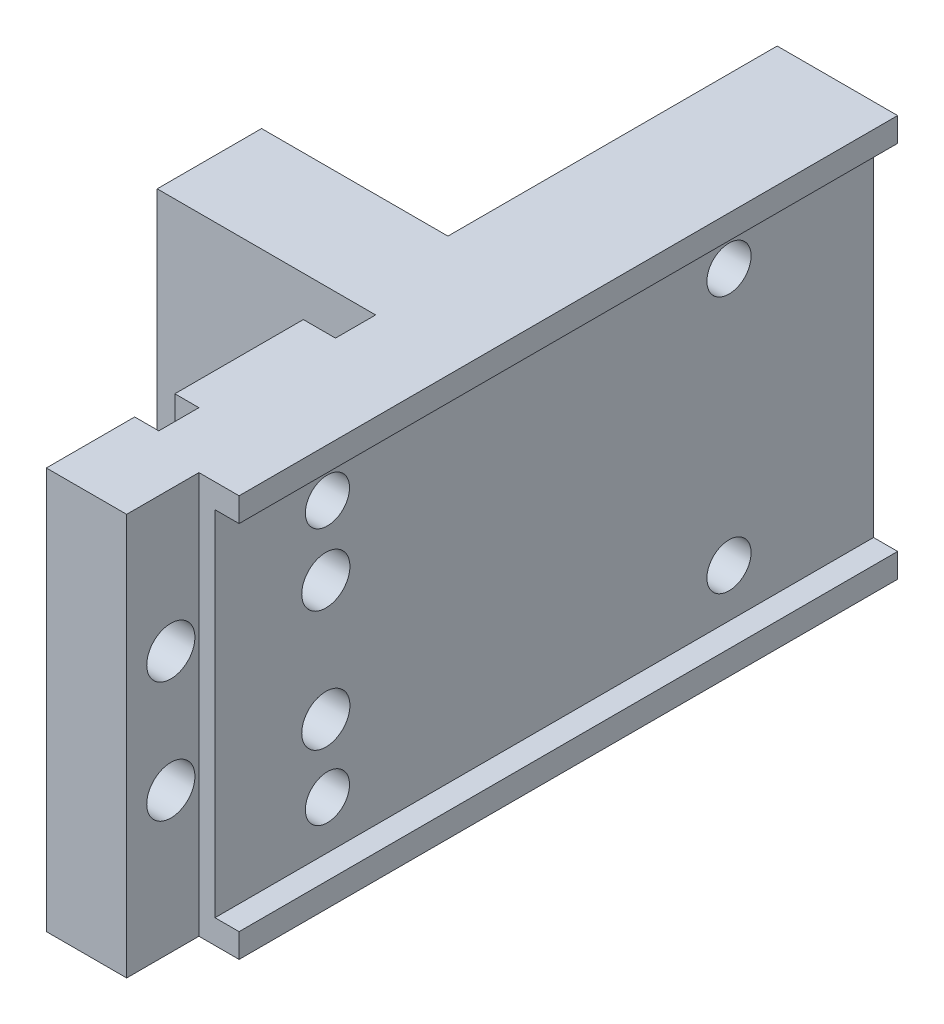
ISO-10303-21;
HEADER;
FILE_DESCRIPTION(('STEP AP214'),'2;1');
FILE_NAME('part.step','',(''),(''),'','','');
FILE_SCHEMA(('AUTOMOTIVE_DESIGN { 1 0 10303 214 1 1 1 1 }'));
ENDSEC;
DATA;
#1=APPLICATION_CONTEXT('core data for automotive mechanical design processes');
#2=APPLICATION_PROTOCOL_DEFINITION('international standard','automotive_design',2000,#1);
#3=PRODUCT_CONTEXT('',#1,'mechanical');
#4=PRODUCT('Part','Part','',(#3));
#5=PRODUCT_RELATED_PRODUCT_CATEGORY('part','',(#4));
#6=PRODUCT_DEFINITION_FORMATION('','',#4);
#7=PRODUCT_DEFINITION_CONTEXT('part definition',#1,'design');
#8=PRODUCT_DEFINITION('design','',#6,#7);
#9=PRODUCT_DEFINITION_SHAPE('','',#8);
#10=(LENGTH_UNIT() NAMED_UNIT(*) SI_UNIT(.MILLI.,.METRE.));
#11=(NAMED_UNIT(*) PLANE_ANGLE_UNIT() SI_UNIT($,.RADIAN.));
#12=(NAMED_UNIT(*) SI_UNIT($,.STERADIAN.) SOLID_ANGLE_UNIT());
#13=UNCERTAINTY_MEASURE_WITH_UNIT(LENGTH_MEASURE(1.E-05),#10,'distance_accuracy_value','');
#14=(GEOMETRIC_REPRESENTATION_CONTEXT(3) GLOBAL_UNCERTAINTY_ASSIGNED_CONTEXT((#13)) GLOBAL_UNIT_ASSIGNED_CONTEXT((#10,
#11,#12)) REPRESENTATION_CONTEXT('',''));
#15=CARTESIAN_POINT('',(0.,0.,0.));
#16=DIRECTION('',(0.,0.,1.));
#17=DIRECTION('',(1.,0.,0.));
#18=AXIS2_PLACEMENT_3D('',#15,#16,#17);
#19=CARTESIAN_POINT('',(-15.,-25.,-41.));
#20=DIRECTION('',(0.,-1.,0.));
#21=DIRECTION('',(0.,0.,-1.));
#22=AXIS2_PLACEMENT_3D('',#19,#20,#21);
#23=PLANE('',#22);
#24=DIRECTION('',(0.,0.,-1.));
#25=VECTOR('',#24,1.);
#26=CARTESIAN_POINT('',(-24.2,-25.,50.001));
#27=LINE('',#26,#25);
#28=CARTESIAN_POINT('',(-24.2,-25.,13.));
#29=VERTEX_POINT('',#28);
#30=CARTESIAN_POINT('',(-24.2,-25.,0.));
#31=VERTEX_POINT('',#30);
#32=EDGE_CURVE('E279',#29,#31,#27,.T.);
#33=ORIENTED_EDGE('',*,*,#32,.T.);
#34=DIRECTION('',(-1.,0.,0.));
#35=VECTOR('',#34,1.);
#36=CARTESIAN_POINT('',(-38.2,-25.0000000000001,0.));
#37=LINE('',#36,#35);
#38=CARTESIAN_POINT('',(-15.,-25.,0.));
#39=VERTEX_POINT('',#38);
#40=EDGE_CURVE('E395',#39,#31,#37,.T.);
#41=ORIENTED_EDGE('',*,*,#40,.F.);
#42=DIRECTION('',(0.,0.,1.));
#43=VECTOR('',#42,1.);
#44=CARTESIAN_POINT('',(-15.,-25.,0.));
#45=LINE('',#44,#43);
#46=CARTESIAN_POINT('',(-15.,-25.,-41.));
#47=VERTEX_POINT('',#46);
#48=EDGE_CURVE('E356',#47,#39,#45,.T.);
#49=ORIENTED_EDGE('',*,*,#48,.F.);
#50=DIRECTION('',(-1.,0.,0.));
#51=VECTOR('',#50,1.);
#52=CARTESIAN_POINT('',(-15.,-25.,-41.));
#53=LINE('',#52,#51);
#54=CARTESIAN_POINT('',(0.,-25.,-41.));
#55=VERTEX_POINT('',#54);
#56=EDGE_CURVE('E361',#55,#47,#53,.T.);
#57=ORIENTED_EDGE('',*,*,#56,.F.);
#58=DIRECTION('',(0.,0.,-1.));
#59=VECTOR('',#58,1.);
#60=CARTESIAN_POINT('',(0.,-25.,-41.));
#61=LINE('',#60,#59);
#62=CARTESIAN_POINT('',(0.,-25.,41.));
#63=VERTEX_POINT('',#62);
#64=EDGE_CURVE('E425',#63,#55,#61,.T.);
#65=ORIENTED_EDGE('',*,*,#64,.F.);
#66=DIRECTION('',(1.,0.,0.));
#67=VECTOR('',#66,1.);
#68=CARTESIAN_POINT('',(0.,-25.,41.));
#69=LINE('',#68,#67);
#70=CARTESIAN_POINT('',(-4.99999999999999,-25.,41.));
#71=VERTEX_POINT('',#70);
#72=EDGE_CURVE('E422',#71,#63,#69,.T.);
#73=ORIENTED_EDGE('',*,*,#72,.F.);
#74=DIRECTION('',(0.,0.,-1.));
#75=VECTOR('',#74,1.);
#76=CARTESIAN_POINT('',(-4.99999999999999,-25.,41.));
#77=LINE('',#76,#75);
#78=CARTESIAN_POINT('',(-4.99999999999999,-25.,50.));
#79=VERTEX_POINT('',#78);
#80=EDGE_CURVE('E420',#79,#71,#77,.T.);
#81=ORIENTED_EDGE('',*,*,#80,.F.);
#82=DIRECTION('',(1.,0.,0.));
#83=VECTOR('',#82,1.);
#84=CARTESIAN_POINT('',(-4.99999999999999,-25.,50.));
#85=LINE('',#84,#83);
#86=CARTESIAN_POINT('',(-15.,-25.,50.));
#87=VERTEX_POINT('',#86);
#88=EDGE_CURVE('E418',#87,#79,#85,.T.);
#89=ORIENTED_EDGE('',*,*,#88,.F.);
#90=DIRECTION('',(0.,0.,1.));
#91=VECTOR('',#90,1.);
#92=CARTESIAN_POINT('',(-15.,-25.,50.));
#93=LINE('',#92,#91);
#94=CARTESIAN_POINT('',(-15.,-25.,39.));
#95=VERTEX_POINT('',#94);
#96=EDGE_CURVE('E416',#95,#87,#93,.T.);
#97=ORIENTED_EDGE('',*,*,#96,.F.);
#98=DIRECTION('',(-1.,0.,0.));
#99=VECTOR('',#98,1.);
#100=CARTESIAN_POINT('',(-15.,-25.,39.));
#101=LINE('',#100,#99);
#102=CARTESIAN_POINT('',(-12.,-25.,39.));
#103=VERTEX_POINT('',#102);
#104=EDGE_CURVE('E414',#103,#95,#101,.T.);
#105=ORIENTED_EDGE('',*,*,#104,.F.);
#106=DIRECTION('',(0.,0.,1.));
#107=VECTOR('',#106,1.);
#108=CARTESIAN_POINT('',(-12.,-25.,39.));
#109=LINE('',#108,#107);
#110=CARTESIAN_POINT('',(-12.,-25.,34.));
#111=VERTEX_POINT('',#110);
#112=EDGE_CURVE('E412',#111,#103,#109,.T.);
#113=ORIENTED_EDGE('',*,*,#112,.F.);
#114=DIRECTION('',(1.,0.,0.));
#115=VECTOR('',#114,1.);
#116=CARTESIAN_POINT('',(-12.,-25.,34.));
#117=LINE('',#116,#115);
#118=CARTESIAN_POINT('',(-15.,-25.,34.));
#119=VERTEX_POINT('',#118);
#120=EDGE_CURVE('E410',#119,#111,#117,.T.);
#121=ORIENTED_EDGE('',*,*,#120,.F.);
#122=DIRECTION('',(0.,0.,1.));
#123=VECTOR('',#122,1.);
#124=CARTESIAN_POINT('',(-15.,-25.,34.));
#125=LINE('',#124,#123);
#126=CARTESIAN_POINT('',(-15.,-25.,18.));
#127=VERTEX_POINT('',#126);
#128=EDGE_CURVE('E408',#127,#119,#125,.T.);
#129=ORIENTED_EDGE('',*,*,#128,.F.);
#130=DIRECTION('',(-1.,0.,0.));
#131=VECTOR('',#130,1.);
#132=CARTESIAN_POINT('',(-15.,-25.,18.));
#133=LINE('',#132,#131);
#134=CARTESIAN_POINT('',(-11.,-25.,18.));
#135=VERTEX_POINT('',#134);
#136=EDGE_CURVE('E406',#135,#127,#133,.T.);
#137=ORIENTED_EDGE('',*,*,#136,.F.);
#138=DIRECTION('',(0.,0.,1.));
#139=VECTOR('',#138,1.);
#140=CARTESIAN_POINT('',(-11.,-25.,18.));
#141=LINE('',#140,#139);
#142=CARTESIAN_POINT('',(-11.,-25.,13.));
#143=VERTEX_POINT('',#142);
#144=EDGE_CURVE('E404',#143,#135,#141,.T.);
#145=ORIENTED_EDGE('',*,*,#144,.F.);
#146=DIRECTION('',(1.,0.,0.));
#147=VECTOR('',#146,1.);
#148=CARTESIAN_POINT('',(-11.,-25.,13.));
#149=LINE('',#148,#147);
#150=EDGE_CURVE('E400',#29,#143,#149,.T.);
#151=ORIENTED_EDGE('',*,*,#150,.F.);
#152=EDGE_LOOP('',(#33,#41,#49,#57,#65,#73,#81,#89,#97,#105,#113,#121,#129,#137,#145,#151));
#153=FACE_BOUND('',#152,.T.);
#154=ADVANCED_FACE('F31',(#153),#23,.T.);
#155=CARTESIAN_POINT('',(-15.,25.,0.));
#156=DIRECTION('',(1.,0.,0.));
#157=DIRECTION('',(0.,0.,-1.));
#158=AXIS2_PLACEMENT_3D('',#155,#156,#157);
#159=PLANE('',#158);
#160=DIRECTION('',(0.,-1.,0.));
#161=VECTOR('',#160,1.);
#162=CARTESIAN_POINT('',(-15.,25.,-41.));
#163=LINE('',#162,#161);
#164=CARTESIAN_POINT('',(-15.,25.,-41.));
#165=VERTEX_POINT('',#164);
#166=CARTESIAN_POINT('',(-15.,22.,-41.));
#167=VERTEX_POINT('',#166);
#168=EDGE_CURVE('E430',#165,#167,#163,.T.);
#169=ORIENTED_EDGE('',*,*,#168,.T.);
#170=DIRECTION('',(0.,0.,-1.));
#171=VECTOR('',#170,1.);
#172=CARTESIAN_POINT('',(-15.,22.,-41.));
#173=LINE('',#172,#171);
#174=CARTESIAN_POINT('',(-15.,22.,-6.));
#175=VERTEX_POINT('',#174);
#176=EDGE_CURVE('E295',#175,#167,#173,.T.);
#177=ORIENTED_EDGE('',*,*,#176,.F.);
#178=CARTESIAN_POINT('',(-15.,16.,-6.));
#179=DIRECTION('',(-1.,0.,0.));
#180=DIRECTION('',(0.,0.,-1.));
#181=AXIS2_PLACEMENT_3D('',#178,#179,#180);
#182=CIRCLE('',#181,6.);
#183=CARTESIAN_POINT('',(-15.,16.,0.));
#184=VERTEX_POINT('',#183);
#185=EDGE_CURVE('E315',#184,#175,#182,.T.);
#186=ORIENTED_EDGE('',*,*,#185,.F.);
#187=DIRECTION('',(0.,-1.,0.));
#188=VECTOR('',#187,1.);
#189=CARTESIAN_POINT('',(-15.,25.,0.));
#190=LINE('',#189,#188);
#191=CARTESIAN_POINT('',(-15.,25.,0.));
#192=VERTEX_POINT('',#191);
#193=EDGE_CURVE('E11',#192,#184,#190,.T.);
#194=ORIENTED_EDGE('',*,*,#193,.F.);
#195=DIRECTION('',(0.,0.,1.));
#196=VECTOR('',#195,1.);
#197=CARTESIAN_POINT('',(-15.,25.,0.));
#198=LINE('',#197,#196);
#199=EDGE_CURVE('E357',#165,#192,#198,.T.);
#200=ORIENTED_EDGE('',*,*,#199,.F.);
#201=EDGE_LOOP('',(#169,#177,#186,#194,#200));
#202=FACE_BOUND('',#201,.T.);
#203=ADVANCED_FACE('F537',(#202),#159,.F.);
#204=CARTESIAN_POINT('',(0.,25.,-41.));
#205=DIRECTION('',(-1.,0.,0.));
#206=DIRECTION('',(0.,0.,1.));
#207=AXIS2_PLACEMENT_3D('',#204,#205,#206);
#208=PLANE('',#207);
#209=DIRECTION('',(0.,-1.,0.));
#210=VECTOR('',#209,1.);
#211=CARTESIAN_POINT('',(0.,25.,41.));
#212=LINE('',#211,#210);
#213=CARTESIAN_POINT('',(0.,25.,41.));
#214=VERTEX_POINT('',#213);
#215=CARTESIAN_POINT('',(0.,22.,41.));
#216=VERTEX_POINT('',#215);
#217=EDGE_CURVE('E438',#214,#216,#212,.T.);
#218=ORIENTED_EDGE('',*,*,#217,.T.);
#219=DIRECTION('',(0.,0.,-1.));
#220=VECTOR('',#219,1.);
#221=CARTESIAN_POINT('',(0.,22.,50.001));
#222=LINE('',#221,#220);
#223=CARTESIAN_POINT('',(0.,22.,-41.));
#224=VERTEX_POINT('',#223);
#225=EDGE_CURVE('E346',#216,#224,#222,.T.);
#226=ORIENTED_EDGE('',*,*,#225,.T.);
#227=DIRECTION('',(0.,-1.,0.));
#228=VECTOR('',#227,1.);
#229=CARTESIAN_POINT('',(0.,25.,-41.));
#230=LINE('',#229,#228);
#231=CARTESIAN_POINT('',(0.,25.,-41.));
#232=VERTEX_POINT('',#231);
#233=EDGE_CURVE('E434',#232,#224,#230,.T.);
#234=ORIENTED_EDGE('',*,*,#233,.F.);
#235=DIRECTION('',(0.,0.,-1.));
#236=VECTOR('',#235,1.);
#237=CARTESIAN_POINT('',(0.,25.,-41.));
#238=LINE('',#237,#236);
#239=EDGE_CURVE('E387',#214,#232,#238,.T.);
#240=ORIENTED_EDGE('',*,*,#239,.F.);
#241=EDGE_LOOP('',(#218,#226,#234,#240));
#242=FACE_BOUND('',#241,.T.);
#243=ADVANCED_FACE('F546',(#242),#208,.F.);
#244=CARTESIAN_POINT('',(-15.,-16.,0.));
#245=VERTEX_POINT('',#244);
#246=EDGE_CURVE('E40',#245,#39,#190,.T.);
#247=ORIENTED_EDGE('',*,*,#246,.F.);
#248=CARTESIAN_POINT('',(-15.,-16.,-5.99999999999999));
#249=DIRECTION('',(-1.,0.,0.));
#250=DIRECTION('',(0.,0.,1.));
#251=AXIS2_PLACEMENT_3D('',#248,#249,#250);
#252=CIRCLE('',#251,6.);
#253=CARTESIAN_POINT('',(-15.,-22.,-5.99999999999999));
#254=VERTEX_POINT('',#253);
#255=EDGE_CURVE('E312',#254,#245,#252,.T.);
#256=ORIENTED_EDGE('',*,*,#255,.F.);
#257=DIRECTION('',(0.,0.,1.));
#258=VECTOR('',#257,1.);
#259=CARTESIAN_POINT('',(-15.,-22.,-41.));
#260=LINE('',#259,#258);
#261=CARTESIAN_POINT('',(-15.,-22.,-41.));
#262=VERTEX_POINT('',#261);
#263=EDGE_CURVE('E290',#262,#254,#260,.T.);
#264=ORIENTED_EDGE('',*,*,#263,.F.);
#265=EDGE_CURVE('E391',#262,#47,#163,.T.);
#266=ORIENTED_EDGE('',*,*,#265,.T.);
#267=ORIENTED_EDGE('',*,*,#48,.T.);
#268=EDGE_LOOP('',(#247,#256,#264,#266,#267));
#269=FACE_BOUND('',#268,.T.);
#270=ADVANCED_FACE('F33',(#269),#159,.F.);
#271=CARTESIAN_POINT('',(-38.2,25.,0.));
#272=DIRECTION('',(0.,0.,1.));
#273=DIRECTION('',(1.,0.,0.));
#274=AXIS2_PLACEMENT_3D('',#271,#272,#273);
#275=PLANE('',#274);
#276=ORIENTED_EDGE('',*,*,#40,.T.);
#277=DIRECTION('',(0.,-1.,0.));
#278=VECTOR('',#277,1.);
#279=CARTESIAN_POINT('',(-24.2,0.,0.));
#280=LINE('',#279,#278);
#281=CARTESIAN_POINT('',(-24.2,-8.23483454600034,0.));
#282=VERTEX_POINT('',#281);
#283=EDGE_CURVE('E276',#282,#31,#280,.T.);
#284=ORIENTED_EDGE('',*,*,#283,.F.);
#285=CARTESIAN_POINT('',(-24.7,0.,0.));
#286=DIRECTION('',(0.,0.,-1.));
#287=DIRECTION('',(-1.,0.,0.));
#288=AXIS2_PLACEMENT_3D('',#285,#286,#287);
#289=CIRCLE('',#288,8.24999999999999);
#290=CARTESIAN_POINT('',(-25.2,-8.23483454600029,0.));
#291=VERTEX_POINT('',#290);
#292=EDGE_CURVE('E282',#291,#282,#289,.T.);
#293=ORIENTED_EDGE('',*,*,#292,.F.);
#294=DIRECTION('',(0.,1.,0.));
#295=VECTOR('',#294,1.);
#296=CARTESIAN_POINT('',(-25.2,0.,0.));
#297=LINE('',#296,#295);
#298=CARTESIAN_POINT('',(-25.2,-25.,0.));
#299=VERTEX_POINT('',#298);
#300=EDGE_CURVE('E48',#299,#291,#297,.T.);
#301=ORIENTED_EDGE('',*,*,#300,.F.);
#302=CARTESIAN_POINT('',(-38.2,-25.0000000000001,0.));
#303=VERTEX_POINT('',#302);
#304=EDGE_CURVE('E394',#299,#303,#37,.T.);
#305=ORIENTED_EDGE('',*,*,#304,.T.);
#306=DIRECTION('',(0.,-1.,0.));
#307=VECTOR('',#306,1.);
#308=CARTESIAN_POINT('',(-38.2,25.,0.));
#309=LINE('',#308,#307);
#310=CARTESIAN_POINT('',(-38.2,25.,0.));
#311=VERTEX_POINT('',#310);
#312=EDGE_CURVE('E474',#311,#303,#309,.T.);
#313=ORIENTED_EDGE('',*,*,#312,.F.);
#314=DIRECTION('',(-1.,0.,0.));
#315=VECTOR('',#314,1.);
#316=CARTESIAN_POINT('',(-38.2,25.,0.));
#317=LINE('',#316,#315);
#318=EDGE_CURVE('E360',#192,#311,#317,.T.);
#319=ORIENTED_EDGE('',*,*,#318,.F.);
#320=ORIENTED_EDGE('',*,*,#193,.T.);
#321=DIRECTION('',(-1.,0.,0.));
#322=VECTOR('',#321,1.);
#323=CARTESIAN_POINT('',(-9.99999999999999,16.,0.));
#324=LINE('',#323,#322);
#325=CARTESIAN_POINT('',(-9.99999999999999,16.,0.));
#326=VERTEX_POINT('',#325);
#327=EDGE_CURVE('E325',#326,#184,#324,.T.);
#328=ORIENTED_EDGE('',*,*,#327,.F.);
#329=DIRECTION('',(0.,1.,0.));
#330=VECTOR('',#329,1.);
#331=CARTESIAN_POINT('',(-9.99999999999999,16.,0.));
#332=LINE('',#331,#330);
#333=CARTESIAN_POINT('',(-9.99999999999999,-16.,0.));
#334=VERTEX_POINT('',#333);
#335=EDGE_CURVE('E301',#334,#326,#332,.T.);
#336=ORIENTED_EDGE('',*,*,#335,.F.);
#337=DIRECTION('',(-1.,0.,0.));
#338=VECTOR('',#337,1.);
#339=CARTESIAN_POINT('',(-9.99999999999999,-16.,0.));
#340=LINE('',#339,#338);
#341=EDGE_CURVE('E327',#334,#245,#340,.T.);
#342=ORIENTED_EDGE('',*,*,#341,.T.);
#343=ORIENTED_EDGE('',*,*,#246,.T.);
#344=EDGE_LOOP('',(#276,#284,#293,#301,#305,#313,#319,#320,#328,#336,#342,#343));
#345=FACE_BOUND('',#344,.T.);
#346=ADVANCED_FACE('F525',(#345),#275,.F.);
#347=CARTESIAN_POINT('',(-38.2,25.,13.));
#348=DIRECTION('',(1.,0.,0.));
#349=DIRECTION('',(0.,0.,-1.));
#350=AXIS2_PLACEMENT_3D('',#347,#348,#349);
#351=PLANE('',#350);
#352=CARTESIAN_POINT('',(-38.2,-15.,6.50000000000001));
#353=DIRECTION('',(-1.,0.,0.));
#354=DIRECTION('',(0.,0.,1.));
#355=AXIS2_PLACEMENT_3D('',#352,#353,#354);
#356=CIRCLE('',#355,5.5);
#357=CARTESIAN_POINT('',(-38.2,-15.,12.));
#358=VERTEX_POINT('',#357);
#359=EDGE_CURVE('E263',#358,#358,#356,.T.);
#360=ORIENTED_EDGE('',*,*,#359,.F.);
#361=EDGE_LOOP('',(#360));
#362=FACE_BOUND('',#361,.T.);
#363=DIRECTION('',(0.,0.,1.));
#364=VECTOR('',#363,1.);
#365=CARTESIAN_POINT('',(-38.2,-25.,13.));
#366=LINE('',#365,#364);
#367=CARTESIAN_POINT('',(-38.2,-25.,13.));
#368=VERTEX_POINT('',#367);
#369=EDGE_CURVE('E398',#303,#368,#366,.T.);
#370=ORIENTED_EDGE('',*,*,#369,.T.);
#371=DIRECTION('',(0.,-1.,0.));
#372=VECTOR('',#371,1.);
#373=CARTESIAN_POINT('',(-38.2,25.,13.));
#374=LINE('',#373,#372);
#375=CARTESIAN_POINT('',(-38.2,25.,13.));
#376=VERTEX_POINT('',#375);
#377=EDGE_CURVE('E471',#376,#368,#374,.T.);
#378=ORIENTED_EDGE('',*,*,#377,.F.);
#379=DIRECTION('',(0.,0.,1.));
#380=VECTOR('',#379,1.);
#381=CARTESIAN_POINT('',(-38.2,25.,13.));
#382=LINE('',#381,#380);
#383=EDGE_CURVE('E363',#311,#376,#382,.T.);
#384=ORIENTED_EDGE('',*,*,#383,.F.);
#385=ORIENTED_EDGE('',*,*,#312,.T.);
#386=EDGE_LOOP('',(#370,#378,#384,#385));
#387=FACE_BOUND('',#386,.T.);
#388=ADVANCED_FACE('F590',(#362,#387),#351,.F.);
#389=CARTESIAN_POINT('',(-11.,25.,13.));
#390=DIRECTION('',(0.,0.,-1.));
#391=DIRECTION('',(-1.,0.,0.));
#392=AXIS2_PLACEMENT_3D('',#389,#390,#391);
#393=PLANE('',#392);
#394=CARTESIAN_POINT('',(-24.7,0.,13.));
#395=DIRECTION('',(0.,0.,-1.));
#396=DIRECTION('',(-1.,0.,0.));
#397=AXIS2_PLACEMENT_3D('',#394,#395,#396);
#398=CIRCLE('',#397,8.24999999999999);
#399=CARTESIAN_POINT('',(-25.2,-8.2348345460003,13.));
#400=VERTEX_POINT('',#399);
#401=CARTESIAN_POINT('',(-24.2,-8.23483454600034,13.));
#402=VERTEX_POINT('',#401);
#403=EDGE_CURVE('E287',#400,#402,#398,.T.);
#404=ORIENTED_EDGE('',*,*,#403,.T.);
#405=DIRECTION('',(0.,1.,0.));
#406=VECTOR('',#405,1.);
#407=CARTESIAN_POINT('',(-24.2,0.,13.));
#408=LINE('',#407,#406);
#409=EDGE_CURVE('E56',#29,#402,#408,.T.);
#410=ORIENTED_EDGE('',*,*,#409,.F.);
#411=ORIENTED_EDGE('',*,*,#150,.T.);
#412=DIRECTION('',(0.,-1.,0.));
#413=VECTOR('',#412,1.);
#414=CARTESIAN_POINT('',(-11.,25.,13.));
#415=LINE('',#414,#413);
#416=CARTESIAN_POINT('',(-11.,25.,13.));
#417=VERTEX_POINT('',#416);
#418=EDGE_CURVE('E468',#417,#143,#415,.T.);
#419=ORIENTED_EDGE('',*,*,#418,.F.);
#420=DIRECTION('',(1.,0.,0.));
#421=VECTOR('',#420,1.);
#422=CARTESIAN_POINT('',(-11.,25.,13.));
#423=LINE('',#422,#421);
#424=EDGE_CURVE('E365',#376,#417,#423,.T.);
#425=ORIENTED_EDGE('',*,*,#424,.F.);
#426=ORIENTED_EDGE('',*,*,#377,.T.);
#427=CARTESIAN_POINT('',(-25.2,-25.,13.));
#428=VERTEX_POINT('',#427);
#429=EDGE_CURVE('E401',#368,#428,#149,.T.);
#430=ORIENTED_EDGE('',*,*,#429,.T.);
#431=DIRECTION('',(0.,-1.,0.));
#432=VECTOR('',#431,1.);
#433=CARTESIAN_POINT('',(-25.2,0.,13.));
#434=LINE('',#433,#432);
#435=EDGE_CURVE('E273',#400,#428,#434,.T.);
#436=ORIENTED_EDGE('',*,*,#435,.F.);
#437=EDGE_LOOP('',(#404,#410,#411,#419,#425,#426,#430,#436));
#438=FACE_BOUND('',#437,.T.);
#439=ADVANCED_FACE('F580',(#438),#393,.F.);
#440=CARTESIAN_POINT('',(-11.,25.,18.));
#441=DIRECTION('',(1.,0.,0.));
#442=DIRECTION('',(0.,0.,-1.));
#443=AXIS2_PLACEMENT_3D('',#440,#441,#442);
#444=PLANE('',#443);
#445=ORIENTED_EDGE('',*,*,#144,.T.);
#446=DIRECTION('',(0.,-1.,0.));
#447=VECTOR('',#446,1.);
#448=CARTESIAN_POINT('',(-11.,25.,18.));
#449=LINE('',#448,#447);
#450=CARTESIAN_POINT('',(-11.,25.,18.));
#451=VERTEX_POINT('',#450);
#452=EDGE_CURVE('E465',#451,#135,#449,.T.);
#453=ORIENTED_EDGE('',*,*,#452,.F.);
#454=DIRECTION('',(0.,0.,1.));
#455=VECTOR('',#454,1.);
#456=CARTESIAN_POINT('',(-11.,25.,18.));
#457=LINE('',#456,#455);
#458=EDGE_CURVE('E367',#417,#451,#457,.T.);
#459=ORIENTED_EDGE('',*,*,#458,.F.);
#460=ORIENTED_EDGE('',*,*,#418,.T.);
#461=EDGE_LOOP('',(#445,#453,#459,#460));
#462=FACE_BOUND('',#461,.T.);
#463=ADVANCED_FACE('F596',(#462),#444,.F.);
#464=CARTESIAN_POINT('',(-15.,25.,18.));
#465=DIRECTION('',(0.,0.,1.));
#466=DIRECTION('',(1.,0.,0.));
#467=AXIS2_PLACEMENT_3D('',#464,#465,#466);
#468=PLANE('',#467);
#469=ORIENTED_EDGE('',*,*,#136,.T.);
#470=DIRECTION('',(0.,-1.,0.));
#471=VECTOR('',#470,1.);
#472=CARTESIAN_POINT('',(-15.,25.,18.));
#473=LINE('',#472,#471);
#474=CARTESIAN_POINT('',(-15.,25.,18.));
#475=VERTEX_POINT('',#474);
#476=EDGE_CURVE('E462',#475,#127,#473,.T.);
#477=ORIENTED_EDGE('',*,*,#476,.F.);
#478=DIRECTION('',(-1.,0.,0.));
#479=VECTOR('',#478,1.);
#480=CARTESIAN_POINT('',(-15.,25.,18.));
#481=LINE('',#480,#479);
#482=EDGE_CURVE('E369',#451,#475,#481,.T.);
#483=ORIENTED_EDGE('',*,*,#482,.F.);
#484=ORIENTED_EDGE('',*,*,#452,.T.);
#485=EDGE_LOOP('',(#469,#477,#483,#484));
#486=FACE_BOUND('',#485,.T.);
#487=ADVANCED_FACE('F601',(#486),#468,.F.);
#488=CARTESIAN_POINT('',(-15.,25.,34.));
#489=DIRECTION('',(1.,0.,0.));
#490=DIRECTION('',(0.,0.,-1.));
#491=AXIS2_PLACEMENT_3D('',#488,#489,#490);
#492=PLANE('',#491);
#493=CARTESIAN_POINT('',(-15.,7.5,27.2));
#494=DIRECTION('',(-1.,0.,0.));
#495=DIRECTION('',(0.,0.,1.));
#496=AXIS2_PLACEMENT_3D('',#493,#494,#495);
#497=CIRCLE('',#496,2.99999999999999);
#498=CARTESIAN_POINT('',(-15.,7.5,30.2));
#499=VERTEX_POINT('',#498);
#500=EDGE_CURVE('E764',#499,#499,#497,.T.);
#501=ORIENTED_EDGE('',*,*,#500,.F.);
#502=EDGE_LOOP('',(#501));
#503=FACE_BOUND('',#502,.T.);
#504=CARTESIAN_POINT('',(-15.,-7.50000000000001,27.2));
#505=DIRECTION('',(-1.,0.,0.));
#506=DIRECTION('',(0.,0.,1.));
#507=AXIS2_PLACEMENT_3D('',#504,#505,#506);
#508=CIRCLE('',#507,2.99999999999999);
#509=CARTESIAN_POINT('',(-15.,-7.50000000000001,30.2));
#510=VERTEX_POINT('',#509);
#511=EDGE_CURVE('E780',#510,#510,#508,.T.);
#512=ORIENTED_EDGE('',*,*,#511,.F.);
#513=EDGE_LOOP('',(#512));
#514=FACE_BOUND('',#513,.T.);
#515=CARTESIAN_POINT('',(-15.,16.,27.));
#516=DIRECTION('',(-1.,0.,0.));
#517=DIRECTION('',(0.,0.,1.));
#518=AXIS2_PLACEMENT_3D('',#515,#516,#517);
#519=CIRCLE('',#518,5.);
#520=CARTESIAN_POINT('',(-15.,16.,32.));
#521=VERTEX_POINT('',#520);
#522=EDGE_CURVE('E792',#521,#521,#519,.T.);
#523=ORIENTED_EDGE('',*,*,#522,.F.);
#524=EDGE_LOOP('',(#523));
#525=FACE_BOUND('',#524,.T.);
#526=CARTESIAN_POINT('',(-15.,-16.,27.));
#527=DIRECTION('',(-1.,0.,0.));
#528=DIRECTION('',(0.,0.,1.));
#529=AXIS2_PLACEMENT_3D('',#526,#527,#528);
#530=CIRCLE('',#529,5.);
#531=CARTESIAN_POINT('',(-15.,-16.,32.));
#532=VERTEX_POINT('',#531);
#533=EDGE_CURVE('E479',#532,#532,#530,.T.);
#534=ORIENTED_EDGE('',*,*,#533,.F.);
#535=EDGE_LOOP('',(#534));
#536=FACE_BOUND('',#535,.T.);
#537=ORIENTED_EDGE('',*,*,#128,.T.);
#538=DIRECTION('',(0.,-1.,0.));
#539=VECTOR('',#538,1.);
#540=CARTESIAN_POINT('',(-15.,25.,34.));
#541=LINE('',#540,#539);
#542=CARTESIAN_POINT('',(-15.,25.,34.));
#543=VERTEX_POINT('',#542);
#544=EDGE_CURVE('E459',#543,#119,#541,.T.);
#545=ORIENTED_EDGE('',*,*,#544,.F.);
#546=DIRECTION('',(0.,0.,1.));
#547=VECTOR('',#546,1.);
#548=CARTESIAN_POINT('',(-15.,25.,34.));
#549=LINE('',#548,#547);
#550=EDGE_CURVE('E371',#475,#543,#549,.T.);
#551=ORIENTED_EDGE('',*,*,#550,.F.);
#552=ORIENTED_EDGE('',*,*,#476,.T.);
#553=EDGE_LOOP('',(#537,#545,#551,#552));
#554=FACE_BOUND('',#553,.T.);
#555=ADVANCED_FACE('F607',(#503,#514,#525,#536,#554),#492,.F.);
#556=CARTESIAN_POINT('',(-12.,25.,34.));
#557=DIRECTION('',(0.,0.,-1.));
#558=DIRECTION('',(-1.,0.,0.));
#559=AXIS2_PLACEMENT_3D('',#556,#557,#558);
#560=PLANE('',#559);
#561=ORIENTED_EDGE('',*,*,#120,.T.);
#562=DIRECTION('',(0.,-1.,0.));
#563=VECTOR('',#562,1.);
#564=CARTESIAN_POINT('',(-12.,25.,34.));
#565=LINE('',#564,#563);
#566=CARTESIAN_POINT('',(-12.,25.,34.));
#567=VERTEX_POINT('',#566);
#568=EDGE_CURVE('E456',#567,#111,#565,.T.);
#569=ORIENTED_EDGE('',*,*,#568,.F.);
#570=DIRECTION('',(1.,0.,0.));
#571=VECTOR('',#570,1.);
#572=CARTESIAN_POINT('',(-12.,25.,34.));
#573=LINE('',#572,#571);
#574=EDGE_CURVE('E373',#543,#567,#573,.T.);
#575=ORIENTED_EDGE('',*,*,#574,.F.);
#576=ORIENTED_EDGE('',*,*,#544,.T.);
#577=EDGE_LOOP('',(#561,#569,#575,#576));
#578=FACE_BOUND('',#577,.T.);
#579=ADVANCED_FACE('F611',(#578),#560,.F.);
#580=CARTESIAN_POINT('',(-12.,25.,39.));
#581=DIRECTION('',(1.,0.,0.));
#582=DIRECTION('',(0.,0.,-1.));
#583=AXIS2_PLACEMENT_3D('',#580,#581,#582);
#584=PLANE('',#583);
#585=ORIENTED_EDGE('',*,*,#112,.T.);
#586=DIRECTION('',(0.,-1.,0.));
#587=VECTOR('',#586,1.);
#588=CARTESIAN_POINT('',(-12.,25.,39.));
#589=LINE('',#588,#587);
#590=CARTESIAN_POINT('',(-12.,25.,39.));
#591=VERTEX_POINT('',#590);
#592=EDGE_CURVE('E453',#591,#103,#589,.T.);
#593=ORIENTED_EDGE('',*,*,#592,.F.);
#594=DIRECTION('',(0.,0.,1.));
#595=VECTOR('',#594,1.);
#596=CARTESIAN_POINT('',(-12.,25.,39.));
#597=LINE('',#596,#595);
#598=EDGE_CURVE('E375',#567,#591,#597,.T.);
#599=ORIENTED_EDGE('',*,*,#598,.F.);
#600=ORIENTED_EDGE('',*,*,#568,.T.);
#601=EDGE_LOOP('',(#585,#593,#599,#600));
#602=FACE_BOUND('',#601,.T.);
#603=ADVANCED_FACE('F616',(#602),#584,.F.);
#604=CARTESIAN_POINT('',(-15.,25.,39.));
#605=DIRECTION('',(0.,0.,1.));
#606=DIRECTION('',(1.,0.,0.));
#607=AXIS2_PLACEMENT_3D('',#604,#605,#606);
#608=PLANE('',#607);
#609=ORIENTED_EDGE('',*,*,#104,.T.);
#610=DIRECTION('',(0.,-1.,0.));
#611=VECTOR('',#610,1.);
#612=CARTESIAN_POINT('',(-15.,25.,39.));
#613=LINE('',#612,#611);
#614=CARTESIAN_POINT('',(-15.,25.,39.));
#615=VERTEX_POINT('',#614);
#616=EDGE_CURVE('E450',#615,#95,#613,.T.);
#617=ORIENTED_EDGE('',*,*,#616,.F.);
#618=DIRECTION('',(-1.,0.,0.));
#619=VECTOR('',#618,1.);
#620=CARTESIAN_POINT('',(-15.,25.,39.));
#621=LINE('',#620,#619);
#622=EDGE_CURVE('E377',#591,#615,#621,.T.);
#623=ORIENTED_EDGE('',*,*,#622,.F.);
#624=ORIENTED_EDGE('',*,*,#592,.T.);
#625=EDGE_LOOP('',(#609,#617,#623,#624));
#626=FACE_BOUND('',#625,.T.);
#627=ADVANCED_FACE('F622',(#626),#608,.F.);
#628=CARTESIAN_POINT('',(-15.,25.,50.));
#629=DIRECTION('',(1.,0.,0.));
#630=DIRECTION('',(0.,0.,-1.));
#631=AXIS2_PLACEMENT_3D('',#628,#629,#630);
#632=PLANE('',#631);
#633=CARTESIAN_POINT('',(-15.,7.49999999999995,44.5));
#634=DIRECTION('',(-1.,0.,0.));
#635=DIRECTION('',(0.,0.,1.));
#636=AXIS2_PLACEMENT_3D('',#633,#634,#635);
#637=CIRCLE('',#636,2.99999999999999);
#638=CARTESIAN_POINT('',(-15.,7.49999999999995,47.5));
#639=VERTEX_POINT('',#638);
#640=EDGE_CURVE('E767',#639,#639,#637,.T.);
#641=ORIENTED_EDGE('',*,*,#640,.F.);
#642=EDGE_LOOP('',(#641));
#643=FACE_BOUND('',#642,.T.);
#644=CARTESIAN_POINT('',(-15.,-7.50000000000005,44.5));
#645=DIRECTION('',(-1.,0.,0.));
#646=DIRECTION('',(0.,0.,1.));
#647=AXIS2_PLACEMENT_3D('',#644,#645,#646);
#648=CIRCLE('',#647,2.99999999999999);
#649=CARTESIAN_POINT('',(-15.,-7.50000000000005,47.5));
#650=VERTEX_POINT('',#649);
#651=EDGE_CURVE('E774',#650,#650,#648,.T.);
#652=ORIENTED_EDGE('',*,*,#651,.F.);
#653=EDGE_LOOP('',(#652));
#654=FACE_BOUND('',#653,.T.);
#655=ORIENTED_EDGE('',*,*,#96,.T.);
#656=DIRECTION('',(0.,-1.,0.));
#657=VECTOR('',#656,1.);
#658=CARTESIAN_POINT('',(-15.,25.,50.));
#659=LINE('',#658,#657);
#660=CARTESIAN_POINT('',(-15.,25.,50.));
#661=VERTEX_POINT('',#660);
#662=EDGE_CURVE('E447',#661,#87,#659,.T.);
#663=ORIENTED_EDGE('',*,*,#662,.F.);
#664=DIRECTION('',(0.,0.,1.));
#665=VECTOR('',#664,1.);
#666=CARTESIAN_POINT('',(-15.,25.,50.));
#667=LINE('',#666,#665);
#668=EDGE_CURVE('E379',#615,#661,#667,.T.);
#669=ORIENTED_EDGE('',*,*,#668,.F.);
#670=ORIENTED_EDGE('',*,*,#616,.T.);
#671=EDGE_LOOP('',(#655,#663,#669,#670));
#672=FACE_BOUND('',#671,.T.);
#673=ADVANCED_FACE('F626',(#643,#654,#672),#632,.F.);
#674=CARTESIAN_POINT('',(-4.99999999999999,25.,50.));
#675=DIRECTION('',(0.,0.,-1.));
#676=DIRECTION('',(-1.,0.,0.));
#677=AXIS2_PLACEMENT_3D('',#674,#675,#676);
#678=PLANE('',#677);
#679=ORIENTED_EDGE('',*,*,#88,.T.);
#680=DIRECTION('',(0.,-1.,0.));
#681=VECTOR('',#680,1.);
#682=CARTESIAN_POINT('',(-4.99999999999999,25.,50.));
#683=LINE('',#682,#681);
#684=CARTESIAN_POINT('',(-4.99999999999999,25.,50.));
#685=VERTEX_POINT('',#684);
#686=EDGE_CURVE('E444',#685,#79,#683,.T.);
#687=ORIENTED_EDGE('',*,*,#686,.F.);
#688=DIRECTION('',(1.,0.,0.));
#689=VECTOR('',#688,1.);
#690=CARTESIAN_POINT('',(-4.99999999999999,25.,50.));
#691=LINE('',#690,#689);
#692=EDGE_CURVE('E381',#661,#685,#691,.T.);
#693=ORIENTED_EDGE('',*,*,#692,.F.);
#694=ORIENTED_EDGE('',*,*,#662,.T.);
#695=EDGE_LOOP('',(#679,#687,#693,#694));
#696=FACE_BOUND('',#695,.T.);
#697=ADVANCED_FACE('F631',(#696),#678,.F.);
#698=CARTESIAN_POINT('',(-4.99999999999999,25.,41.));
#699=DIRECTION('',(-1.,0.,0.));
#700=DIRECTION('',(0.,0.,1.));
#701=AXIS2_PLACEMENT_3D('',#698,#699,#700);
#702=PLANE('',#701);
#703=CARTESIAN_POINT('',(-4.99999999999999,7.49999999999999,44.5));
#704=DIRECTION('',(-1.,0.,0.));
#705=DIRECTION('',(0.,0.,1.));
#706=AXIS2_PLACEMENT_3D('',#703,#704,#705);
#707=CIRCLE('',#706,2.99999999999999);
#708=CARTESIAN_POINT('',(-4.99999999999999,7.49999999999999,47.5));
#709=VERTEX_POINT('',#708);
#710=EDGE_CURVE('E772',#709,#709,#707,.T.);
#711=ORIENTED_EDGE('',*,*,#710,.T.);
#712=EDGE_LOOP('',(#711));
#713=FACE_BOUND('',#712,.T.);
#714=CARTESIAN_POINT('',(-4.99999999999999,-7.50000000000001,44.5));
#715=DIRECTION('',(-1.,0.,0.));
#716=DIRECTION('',(0.,0.,1.));
#717=AXIS2_PLACEMENT_3D('',#714,#715,#716);
#718=CIRCLE('',#717,2.99999999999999);
#719=CARTESIAN_POINT('',(-4.99999999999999,-7.50000000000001,47.5));
#720=VERTEX_POINT('',#719);
#721=EDGE_CURVE('E777',#720,#720,#718,.T.);
#722=ORIENTED_EDGE('',*,*,#721,.T.);
#723=EDGE_LOOP('',(#722));
#724=FACE_BOUND('',#723,.T.);
#725=ORIENTED_EDGE('',*,*,#80,.T.);
#726=DIRECTION('',(0.,-1.,0.));
#727=VECTOR('',#726,1.);
#728=CARTESIAN_POINT('',(-4.99999999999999,25.,41.));
#729=LINE('',#728,#727);
#730=CARTESIAN_POINT('',(-4.99999999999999,25.,41.));
#731=VERTEX_POINT('',#730);
#732=EDGE_CURVE('E441',#731,#71,#729,.T.);
#733=ORIENTED_EDGE('',*,*,#732,.F.);
#734=DIRECTION('',(0.,0.,-1.));
#735=VECTOR('',#734,1.);
#736=CARTESIAN_POINT('',(-4.99999999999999,25.,41.));
#737=LINE('',#736,#735);
#738=EDGE_CURVE('E383',#685,#731,#737,.T.);
#739=ORIENTED_EDGE('',*,*,#738,.F.);
#740=ORIENTED_EDGE('',*,*,#686,.T.);
#741=EDGE_LOOP('',(#725,#733,#739,#740));
#742=FACE_BOUND('',#741,.T.);
#743=ADVANCED_FACE('F635',(#713,#724,#742),#702,.F.);
#744=CARTESIAN_POINT('',(0.,25.,41.));
#745=DIRECTION('',(0.,0.,-1.));
#746=DIRECTION('',(-1.,0.,0.));
#747=AXIS2_PLACEMENT_3D('',#744,#745,#746);
#748=PLANE('',#747);
#749=DIRECTION('',(0.,-1.,0.));
#750=VECTOR('',#749,1.);
#751=CARTESIAN_POINT('',(-2.99999999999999,22.,41.));
#752=LINE('',#751,#750);
#753=CARTESIAN_POINT('',(-2.99999999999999,22.,41.));
#754=VERTEX_POINT('',#753);
#755=CARTESIAN_POINT('',(-2.99999999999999,-22.,41.));
#756=VERTEX_POINT('',#755);
#757=EDGE_CURVE('E322',#754,#756,#752,.T.);
#758=ORIENTED_EDGE('',*,*,#757,.F.);
#759=DIRECTION('',(-1.,0.,0.));
#760=VECTOR('',#759,1.);
#761=CARTESIAN_POINT('',(0.,22.,41.));
#762=LINE('',#761,#760);
#763=EDGE_CURVE('E334',#216,#754,#762,.T.);
#764=ORIENTED_EDGE('',*,*,#763,.F.);
#765=ORIENTED_EDGE('',*,*,#217,.F.);
#766=DIRECTION('',(1.,0.,0.));
#767=VECTOR('',#766,1.);
#768=CARTESIAN_POINT('',(0.,25.,41.));
#769=LINE('',#768,#767);
#770=EDGE_CURVE('E385',#731,#214,#769,.T.);
#771=ORIENTED_EDGE('',*,*,#770,.F.);
#772=ORIENTED_EDGE('',*,*,#732,.T.);
#773=ORIENTED_EDGE('',*,*,#72,.T.);
#774=CARTESIAN_POINT('',(0.,-22.,41.));
#775=VERTEX_POINT('',#774);
#776=EDGE_CURVE('E437',#775,#63,#212,.T.);
#777=ORIENTED_EDGE('',*,*,#776,.F.);
#778=DIRECTION('',(1.,0.,0.));
#779=VECTOR('',#778,1.);
#780=CARTESIAN_POINT('',(0.,-22.,41.));
#781=LINE('',#780,#779);
#782=EDGE_CURVE('E349',#756,#775,#781,.T.);
#783=ORIENTED_EDGE('',*,*,#782,.F.);
#784=EDGE_LOOP('',(#758,#764,#765,#771,#772,#773,#777,#783));
#785=FACE_BOUND('',#784,.T.);
#786=ADVANCED_FACE('F553',(#785),#748,.F.);
#787=CARTESIAN_POINT('',(0.,-22.,-41.));
#788=VERTEX_POINT('',#787);
#789=EDGE_CURVE('E433',#788,#55,#230,.T.);
#790=ORIENTED_EDGE('',*,*,#789,.F.);
#791=DIRECTION('',(0.,0.,-1.));
#792=VECTOR('',#791,1.);
#793=CARTESIAN_POINT('',(0.,-22.,50.001));
#794=LINE('',#793,#792);
#795=EDGE_CURVE('E345',#775,#788,#794,.T.);
#796=ORIENTED_EDGE('',*,*,#795,.F.);
#797=ORIENTED_EDGE('',*,*,#776,.T.);
#798=ORIENTED_EDGE('',*,*,#64,.T.);
#799=EDGE_LOOP('',(#790,#796,#797,#798));
#800=FACE_BOUND('',#799,.T.);
#801=ADVANCED_FACE('F564',(#800),#208,.F.);
#802=CARTESIAN_POINT('',(-15.,25.,-41.));
#803=DIRECTION('',(0.,0.,1.));
#804=DIRECTION('',(1.,0.,0.));
#805=AXIS2_PLACEMENT_3D('',#802,#803,#804);
#806=PLANE('',#805);
#807=DIRECTION('',(0.,-1.,0.));
#808=VECTOR('',#807,1.);
#809=CARTESIAN_POINT('',(-9.99999999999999,22.,-41.));
#810=LINE('',#809,#808);
#811=CARTESIAN_POINT('',(-9.99999999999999,22.,-41.));
#812=VERTEX_POINT('',#811);
#813=CARTESIAN_POINT('',(-9.99999999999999,-22.,-41.));
#814=VERTEX_POINT('',#813);
#815=EDGE_CURVE('E291',#812,#814,#810,.T.);
#816=ORIENTED_EDGE('',*,*,#815,.F.);
#817=DIRECTION('',(-1.,0.,0.));
#818=VECTOR('',#817,1.);
#819=CARTESIAN_POINT('',(-9.99999999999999,22.,-41.));
#820=LINE('',#819,#818);
#821=EDGE_CURVE('E319',#812,#167,#820,.T.);
#822=ORIENTED_EDGE('',*,*,#821,.T.);
#823=ORIENTED_EDGE('',*,*,#168,.F.);
#824=DIRECTION('',(-1.,0.,0.));
#825=VECTOR('',#824,1.);
#826=CARTESIAN_POINT('',(-15.,25.,-41.));
#827=LINE('',#826,#825);
#828=EDGE_CURVE('E389',#232,#165,#827,.T.);
#829=ORIENTED_EDGE('',*,*,#828,.F.);
#830=ORIENTED_EDGE('',*,*,#233,.T.);
#831=DIRECTION('',(1.,0.,0.));
#832=VECTOR('',#831,1.);
#833=CARTESIAN_POINT('',(0.,22.,-41.));
#834=LINE('',#833,#832);
#835=CARTESIAN_POINT('',(-2.99999999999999,22.,-41.));
#836=VERTEX_POINT('',#835);
#837=EDGE_CURVE('E343',#836,#224,#834,.T.);
#838=ORIENTED_EDGE('',*,*,#837,.F.);
#839=DIRECTION('',(0.,1.,0.));
#840=VECTOR('',#839,1.);
#841=CARTESIAN_POINT('',(-2.99999999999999,22.,-41.));
#842=LINE('',#841,#840);
#843=CARTESIAN_POINT('',(-2.99999999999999,-22.,-41.));
#844=VERTEX_POINT('',#843);
#845=EDGE_CURVE('E340',#844,#836,#842,.T.);
#846=ORIENTED_EDGE('',*,*,#845,.F.);
#847=DIRECTION('',(-1.,0.,0.));
#848=VECTOR('',#847,1.);
#849=CARTESIAN_POINT('',(0.,-22.,-41.));
#850=LINE('',#849,#848);
#851=EDGE_CURVE('E337',#788,#844,#850,.T.);
#852=ORIENTED_EDGE('',*,*,#851,.F.);
#853=ORIENTED_EDGE('',*,*,#789,.T.);
#854=ORIENTED_EDGE('',*,*,#56,.T.);
#855=ORIENTED_EDGE('',*,*,#265,.F.);
#856=DIRECTION('',(-1.,0.,0.));
#857=VECTOR('',#856,1.);
#858=CARTESIAN_POINT('',(-9.99999999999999,-22.,-41.));
#859=LINE('',#858,#857);
#860=EDGE_CURVE('E309',#814,#262,#859,.T.);
#861=ORIENTED_EDGE('',*,*,#860,.F.);
#862=EDGE_LOOP('',(#816,#822,#823,#829,#830,#838,#846,#852,#853,#854,#855,#861));
#863=FACE_BOUND('',#862,.T.);
#864=ADVANCED_FACE('F513',(#863),#806,.F.);
#865=CARTESIAN_POINT('',(-15.,25.,-41.));
#866=DIRECTION('',(0.,-1.,0.));
#867=DIRECTION('',(0.,0.,-1.));
#868=AXIS2_PLACEMENT_3D('',#865,#866,#867);
#869=PLANE('',#868);
#870=ORIENTED_EDGE('',*,*,#199,.T.);
#871=ORIENTED_EDGE('',*,*,#318,.T.);
#872=ORIENTED_EDGE('',*,*,#383,.T.);
#873=ORIENTED_EDGE('',*,*,#424,.T.);
#874=ORIENTED_EDGE('',*,*,#458,.T.);
#875=ORIENTED_EDGE('',*,*,#482,.T.);
#876=ORIENTED_EDGE('',*,*,#550,.T.);
#877=ORIENTED_EDGE('',*,*,#574,.T.);
#878=ORIENTED_EDGE('',*,*,#598,.T.);
#879=ORIENTED_EDGE('',*,*,#622,.T.);
#880=ORIENTED_EDGE('',*,*,#668,.T.);
#881=ORIENTED_EDGE('',*,*,#692,.T.);
#882=ORIENTED_EDGE('',*,*,#738,.T.);
#883=ORIENTED_EDGE('',*,*,#770,.T.);
#884=ORIENTED_EDGE('',*,*,#239,.T.);
#885=ORIENTED_EDGE('',*,*,#828,.T.);
#886=EDGE_LOOP('',(#870,#871,#872,#873,#874,#875,#876,#877,#878,#879,#880,#881,#882,#883,#884,#885));
#887=FACE_BOUND('',#886,.T.);
#888=ADVANCED_FACE('F539',(#887),#869,.F.);
#889=DIRECTION('',(0.,0.,-1.));
#890=VECTOR('',#889,1.);
#891=CARTESIAN_POINT('',(-25.2,-25.,50.001));
#892=LINE('',#891,#890);
#893=EDGE_CURVE('E280',#428,#299,#892,.T.);
#894=ORIENTED_EDGE('',*,*,#893,.F.);
#895=ORIENTED_EDGE('',*,*,#429,.F.);
#896=ORIENTED_EDGE('',*,*,#369,.F.);
#897=ORIENTED_EDGE('',*,*,#304,.F.);
#898=EDGE_LOOP('',(#894,#895,#896,#897));
#899=FACE_BOUND('',#898,.T.);
#900=ADVANCED_FACE('F586',(#899),#23,.T.);
#901=CARTESIAN_POINT('',(0.,22.,50.001));
#902=DIRECTION('',(0.,1.,0.));
#903=DIRECTION('',(0.,0.,1.));
#904=AXIS2_PLACEMENT_3D('',#901,#902,#903);
#905=PLANE('',#904);
#906=ORIENTED_EDGE('',*,*,#763,.T.);
#907=DIRECTION('',(0.,0.,-1.));
#908=VECTOR('',#907,1.);
#909=CARTESIAN_POINT('',(-2.99999999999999,22.,50.001));
#910=LINE('',#909,#908);
#911=EDGE_CURVE('E350',#754,#836,#910,.T.);
#912=ORIENTED_EDGE('',*,*,#911,.T.);
#913=ORIENTED_EDGE('',*,*,#837,.T.);
#914=ORIENTED_EDGE('',*,*,#225,.F.);
#915=EDGE_LOOP('',(#906,#912,#913,#914));
#916=FACE_BOUND('',#915,.T.);
#917=ADVANCED_FACE('F550',(#916),#905,.F.);
#918=CARTESIAN_POINT('',(-2.99999999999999,22.,50.001));
#919=DIRECTION('',(-1.,0.,0.));
#920=DIRECTION('',(0.,0.,1.));
#921=AXIS2_PLACEMENT_3D('',#918,#919,#920);
#922=PLANE('',#921);
#923=CARTESIAN_POINT('',(-2.99999999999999,7.5,27.2));
#924=DIRECTION('',(-1.,0.,0.));
#925=DIRECTION('',(0.,0.,1.));
#926=AXIS2_PLACEMENT_3D('',#923,#924,#925);
#927=CIRCLE('',#926,2.99999999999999);
#928=CARTESIAN_POINT('',(-2.99999999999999,7.5,30.2));
#929=VERTEX_POINT('',#928);
#930=EDGE_CURVE('E761',#929,#929,#927,.T.);
#931=ORIENTED_EDGE('',*,*,#930,.T.);
#932=EDGE_LOOP('',(#931));
#933=FACE_BOUND('',#932,.T.);
#934=CARTESIAN_POINT('',(-2.99999999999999,-7.50000000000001,27.2));
#935=DIRECTION('',(-1.,0.,0.));
#936=DIRECTION('',(0.,0.,1.));
#937=AXIS2_PLACEMENT_3D('',#934,#935,#936);
#938=CIRCLE('',#937,2.99999999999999);
#939=CARTESIAN_POINT('',(-2.99999999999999,-7.50000000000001,30.2));
#940=VERTEX_POINT('',#939);
#941=EDGE_CURVE('E783',#940,#940,#938,.T.);
#942=ORIENTED_EDGE('',*,*,#941,.T.);
#943=EDGE_LOOP('',(#942));
#944=FACE_BOUND('',#943,.T.);
#945=CARTESIAN_POINT('',(-2.99999999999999,16.,27.0000000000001));
#946=DIRECTION('',(-1.,0.,0.));
#947=DIRECTION('',(0.,0.,1.));
#948=AXIS2_PLACEMENT_3D('',#945,#946,#947);
#949=CIRCLE('',#948,2.75);
#950=CARTESIAN_POINT('',(-2.99999999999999,16.,29.7500000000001));
#951=VERTEX_POINT('',#950);
#952=EDGE_CURVE('E35',#951,#951,#949,.T.);
#953=ORIENTED_EDGE('',*,*,#952,.T.);
#954=EDGE_LOOP('',(#953));
#955=FACE_BOUND('',#954,.T.);
#956=CARTESIAN_POINT('',(-2.99999999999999,-16.,27.));
#957=DIRECTION('',(-1.,0.,0.));
#958=DIRECTION('',(0.,0.,1.));
#959=AXIS2_PLACEMENT_3D('',#956,#957,#958);
#960=CIRCLE('',#959,2.75);
#961=CARTESIAN_POINT('',(-2.99999999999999,-16.,29.75));
#962=VERTEX_POINT('',#961);
#963=EDGE_CURVE('E476',#962,#962,#960,.T.);
#964=ORIENTED_EDGE('',*,*,#963,.T.);
#965=EDGE_LOOP('',(#964));
#966=FACE_BOUND('',#965,.T.);
#967=CARTESIAN_POINT('',(-2.99999999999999,16.,-23.));
#968=DIRECTION('',(-1.,0.,0.));
#969=DIRECTION('',(0.,0.,1.));
#970=AXIS2_PLACEMENT_3D('',#967,#968,#969);
#971=CIRCLE('',#970,2.74999999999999);
#972=CARTESIAN_POINT('',(-2.99999999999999,16.,-20.25));
#973=VERTEX_POINT('',#972);
#974=EDGE_CURVE('E483',#973,#973,#971,.T.);
#975=ORIENTED_EDGE('',*,*,#974,.T.);
#976=EDGE_LOOP('',(#975));
#977=FACE_BOUND('',#976,.T.);
#978=CARTESIAN_POINT('',(-2.99999999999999,-16.,-23.));
#979=DIRECTION('',(-1.,0.,0.));
#980=DIRECTION('',(0.,0.,1.));
#981=AXIS2_PLACEMENT_3D('',#978,#979,#980);
#982=CIRCLE('',#981,2.74999999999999);
#983=CARTESIAN_POINT('',(-2.99999999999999,-16.,-20.25));
#984=VERTEX_POINT('',#983);
#985=EDGE_CURVE('E242',#984,#984,#982,.T.);
#986=ORIENTED_EDGE('',*,*,#985,.T.);
#987=EDGE_LOOP('',(#986));
#988=FACE_BOUND('',#987,.T.);
#989=ORIENTED_EDGE('',*,*,#757,.T.);
#990=DIRECTION('',(0.,0.,-1.));
#991=VECTOR('',#990,1.);
#992=CARTESIAN_POINT('',(-2.99999999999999,-22.,50.001));
#993=LINE('',#992,#991);
#994=EDGE_CURVE('E352',#756,#844,#993,.T.);
#995=ORIENTED_EDGE('',*,*,#994,.T.);
#996=ORIENTED_EDGE('',*,*,#845,.T.);
#997=ORIENTED_EDGE('',*,*,#911,.F.);
#998=EDGE_LOOP('',(#989,#995,#996,#997));
#999=FACE_BOUND('',#998,.T.);
#1000=ADVANCED_FACE('F558',(#933,#944,#955,#966,#977,#988,#999),#922,.F.);
#1001=CARTESIAN_POINT('',(0.,-22.,50.001));
#1002=DIRECTION('',(0.,-1.,0.));
#1003=DIRECTION('',(0.,0.,-1.));
#1004=AXIS2_PLACEMENT_3D('',#1001,#1002,#1003);
#1005=PLANE('',#1004);
#1006=ORIENTED_EDGE('',*,*,#782,.T.);
#1007=ORIENTED_EDGE('',*,*,#795,.T.);
#1008=ORIENTED_EDGE('',*,*,#851,.T.);
#1009=ORIENTED_EDGE('',*,*,#994,.F.);
#1010=EDGE_LOOP('',(#1006,#1007,#1008,#1009));
#1011=FACE_BOUND('',#1010,.T.);
#1012=ADVANCED_FACE('F665',(#1011),#1005,.F.);
#1013=CARTESIAN_POINT('',(-9.99999999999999,22.,-41.));
#1014=DIRECTION('',(0.,1.,0.));
#1015=DIRECTION('',(0.,0.,1.));
#1016=AXIS2_PLACEMENT_3D('',#1013,#1014,#1015);
#1017=PLANE('',#1016);
#1018=ORIENTED_EDGE('',*,*,#176,.T.);
#1019=ORIENTED_EDGE('',*,*,#821,.F.);
#1020=DIRECTION('',(0.,0.,-1.));
#1021=VECTOR('',#1020,1.);
#1022=CARTESIAN_POINT('',(-9.99999999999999,22.,-41.));
#1023=LINE('',#1022,#1021);
#1024=CARTESIAN_POINT('',(-9.99999999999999,22.,-6.));
#1025=VERTEX_POINT('',#1024);
#1026=EDGE_CURVE('E307',#1025,#812,#1023,.T.);
#1027=ORIENTED_EDGE('',*,*,#1026,.F.);
#1028=DIRECTION('',(-1.,0.,0.));
#1029=VECTOR('',#1028,1.);
#1030=CARTESIAN_POINT('',(-9.99999999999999,22.,-6.));
#1031=LINE('',#1030,#1029);
#1032=EDGE_CURVE('E323',#1025,#175,#1031,.T.);
#1033=ORIENTED_EDGE('',*,*,#1032,.T.);
#1034=EDGE_LOOP('',(#1018,#1019,#1027,#1033));
#1035=FACE_BOUND('',#1034,.T.);
#1036=ADVANCED_FACE('F532',(#1035),#1017,.F.);
#1037=CARTESIAN_POINT('',(-9.99999999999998,16.,-6.));
#1038=DIRECTION('',(-1.,0.,0.));
#1039=DIRECTION('',(0.,0.,1.));
#1040=AXIS2_PLACEMENT_3D('',#1037,#1038,#1039);
#1041=CYLINDRICAL_SURFACE('',#1040,6.);
#1042=ORIENTED_EDGE('',*,*,#185,.T.);
#1043=ORIENTED_EDGE('',*,*,#1032,.F.);
#1044=CARTESIAN_POINT('',(-9.99999999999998,16.,-6.));
#1045=DIRECTION('',(-1.,0.,0.));
#1046=DIRECTION('',(0.,0.,-1.));
#1047=AXIS2_PLACEMENT_3D('',#1044,#1045,#1046);
#1048=CIRCLE('',#1047,6.);
#1049=EDGE_CURVE('E304',#326,#1025,#1048,.T.);
#1050=ORIENTED_EDGE('',*,*,#1049,.F.);
#1051=ORIENTED_EDGE('',*,*,#327,.T.);
#1052=EDGE_LOOP('',(#1042,#1043,#1050,#1051));
#1053=FACE_BOUND('',#1052,.T.);
#1054=ADVANCED_FACE('F529',(#1053),#1041,.F.);
#1055=CARTESIAN_POINT('',(-9.99999999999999,-16.,-5.99999999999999));
#1056=DIRECTION('',(-1.,0.,0.));
#1057=DIRECTION('',(0.,0.,1.));
#1058=AXIS2_PLACEMENT_3D('',#1055,#1056,#1057);
#1059=CYLINDRICAL_SURFACE('',#1058,6.);
#1060=ORIENTED_EDGE('',*,*,#255,.T.);
#1061=ORIENTED_EDGE('',*,*,#341,.F.);
#1062=CARTESIAN_POINT('',(-9.99999999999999,-16.,-5.99999999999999));
#1063=DIRECTION('',(-1.,0.,0.));
#1064=DIRECTION('',(0.,0.,1.));
#1065=AXIS2_PLACEMENT_3D('',#1062,#1063,#1064);
#1066=CIRCLE('',#1065,6.);
#1067=CARTESIAN_POINT('',(-9.99999999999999,-22.,-5.99999999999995));
#1068=VERTEX_POINT('',#1067);
#1069=EDGE_CURVE('E298',#1068,#334,#1066,.T.);
#1070=ORIENTED_EDGE('',*,*,#1069,.F.);
#1071=DIRECTION('',(-1.,0.,0.));
#1072=VECTOR('',#1071,1.);
#1073=CARTESIAN_POINT('',(-9.99999999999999,-22.,-5.99999999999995));
#1074=LINE('',#1073,#1072);
#1075=EDGE_CURVE('E329',#1068,#254,#1074,.T.);
#1076=ORIENTED_EDGE('',*,*,#1075,.T.);
#1077=EDGE_LOOP('',(#1060,#1061,#1070,#1076));
#1078=FACE_BOUND('',#1077,.T.);
#1079=ADVANCED_FACE('F520',(#1078),#1059,.F.);
#1080=CARTESIAN_POINT('',(-9.99999999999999,-22.,-41.));
#1081=DIRECTION('',(0.,-1.,0.));
#1082=DIRECTION('',(0.,0.,-1.));
#1083=AXIS2_PLACEMENT_3D('',#1080,#1081,#1082);
#1084=PLANE('',#1083);
#1085=ORIENTED_EDGE('',*,*,#263,.T.);
#1086=ORIENTED_EDGE('',*,*,#1075,.F.);
#1087=DIRECTION('',(0.,0.,1.));
#1088=VECTOR('',#1087,1.);
#1089=CARTESIAN_POINT('',(-9.99999999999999,-22.,-41.));
#1090=LINE('',#1089,#1088);
#1091=EDGE_CURVE('E294',#814,#1068,#1090,.T.);
#1092=ORIENTED_EDGE('',*,*,#1091,.F.);
#1093=ORIENTED_EDGE('',*,*,#860,.T.);
#1094=EDGE_LOOP('',(#1085,#1086,#1092,#1093));
#1095=FACE_BOUND('',#1094,.T.);
#1096=ADVANCED_FACE('F504',(#1095),#1084,.F.);
#1097=CARTESIAN_POINT('',(-9.99999999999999,-16.,-5.99999999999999));
#1098=DIRECTION('',(-1.,0.,0.));
#1099=DIRECTION('',(0.,0.,1.));
#1100=AXIS2_PLACEMENT_3D('',#1097,#1098,#1099);
#1101=PLANE('',#1100);
#1102=CARTESIAN_POINT('',(-10.,15.9999999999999,-23.));
#1103=DIRECTION('',(-1.,0.,0.));
#1104=DIRECTION('',(0.,0.,1.));
#1105=AXIS2_PLACEMENT_3D('',#1102,#1103,#1104);
#1106=CIRCLE('',#1105,2.74999999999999);
#1107=CARTESIAN_POINT('',(-10.,15.9999999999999,-20.25));
#1108=VERTEX_POINT('',#1107);
#1109=EDGE_CURVE('E478',#1108,#1108,#1106,.T.);
#1110=ORIENTED_EDGE('',*,*,#1109,.F.);
#1111=EDGE_LOOP('',(#1110));
#1112=FACE_BOUND('',#1111,.T.);
#1113=CARTESIAN_POINT('',(-10.,-16.,-23.));
#1114=DIRECTION('',(-1.,0.,0.));
#1115=DIRECTION('',(0.,0.,1.));
#1116=AXIS2_PLACEMENT_3D('',#1113,#1114,#1115);
#1117=CIRCLE('',#1116,2.74999999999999);
#1118=CARTESIAN_POINT('',(-10.,-16.,-20.25));
#1119=VERTEX_POINT('',#1118);
#1120=EDGE_CURVE('E248',#1119,#1119,#1117,.T.);
#1121=ORIENTED_EDGE('',*,*,#1120,.F.);
#1122=EDGE_LOOP('',(#1121));
#1123=FACE_BOUND('',#1122,.T.);
#1124=ORIENTED_EDGE('',*,*,#815,.T.);
#1125=ORIENTED_EDGE('',*,*,#1091,.T.);
#1126=ORIENTED_EDGE('',*,*,#1069,.T.);
#1127=ORIENTED_EDGE('',*,*,#335,.T.);
#1128=ORIENTED_EDGE('',*,*,#1049,.T.);
#1129=ORIENTED_EDGE('',*,*,#1026,.T.);
#1130=EDGE_LOOP('',(#1124,#1125,#1126,#1127,#1128,#1129));
#1131=FACE_BOUND('',#1130,.T.);
#1132=ADVANCED_FACE('F500',(#1112,#1123,#1131),#1101,.T.);
#1133=CARTESIAN_POINT('',(-24.7,0.,0.));
#1134=DIRECTION('',(0.,0.,-1.));
#1135=DIRECTION('',(-1.,0.,0.));
#1136=AXIS2_PLACEMENT_3D('',#1133,#1134,#1135);
#1137=CYLINDRICAL_SURFACE('',#1136,8.24999999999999);
#1138=ORIENTED_EDGE('',*,*,#292,.T.);
#1139=DIRECTION('',(0.,0.,-1.));
#1140=VECTOR('',#1139,1.);
#1141=CARTESIAN_POINT('',(-24.2,-8.23483454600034,0.));
#1142=LINE('',#1141,#1140);
#1143=EDGE_CURVE('E271',#402,#282,#1142,.T.);
#1144=ORIENTED_EDGE('',*,*,#1143,.F.);
#1145=ORIENTED_EDGE('',*,*,#403,.F.);
#1146=DIRECTION('',(0.,0.,-1.));
#1147=VECTOR('',#1146,1.);
#1148=CARTESIAN_POINT('',(-25.2,-8.23483454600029,0.));
#1149=LINE('',#1148,#1147);
#1150=EDGE_CURVE('E269',#291,#400,#1149,.F.);
#1151=ORIENTED_EDGE('',*,*,#1150,.F.);
#1152=EDGE_LOOP('',(#1138,#1144,#1145,#1151));
#1153=FACE_BOUND('',#1152,.T.);
#1154=ADVANCED_FACE('F503',(#1153),#1137,.F.);
#1155=CARTESIAN_POINT('',(-25.2,0.,50.001));
#1156=DIRECTION('',(-1.,0.,0.));
#1157=DIRECTION('',(0.,-1.,0.));
#1158=AXIS2_PLACEMENT_3D('',#1155,#1156,#1157);
#1159=PLANE('',#1158);
#1160=CARTESIAN_POINT('',(-25.2,-15.,6.50000000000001));
#1161=DIRECTION('',(-1.,0.,0.));
#1162=DIRECTION('',(0.,-1.,0.));
#1163=AXIS2_PLACEMENT_3D('',#1160,#1161,#1162);
#1164=CIRCLE('',#1163,3.3);
#1165=CARTESIAN_POINT('',(-25.2,-18.3,6.50000000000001));
#1166=VERTEX_POINT('',#1165);
#1167=EDGE_CURVE('E266',#1166,#1166,#1164,.T.);
#1168=ORIENTED_EDGE('',*,*,#1167,.T.);
#1169=EDGE_LOOP('',(#1168));
#1170=FACE_BOUND('',#1169,.T.);
#1171=ORIENTED_EDGE('',*,*,#435,.T.);
#1172=ORIENTED_EDGE('',*,*,#893,.T.);
#1173=ORIENTED_EDGE('',*,*,#300,.T.);
#1174=ORIENTED_EDGE('',*,*,#1150,.T.);
#1175=EDGE_LOOP('',(#1171,#1172,#1173,#1174));
#1176=FACE_BOUND('',#1175,.T.);
#1177=ADVANCED_FACE('F577',(#1170,#1176),#1159,.F.);
#1178=CARTESIAN_POINT('',(-24.2,0.,50.001));
#1179=DIRECTION('',(1.,0.,0.));
#1180=DIRECTION('',(0.,1.,0.));
#1181=AXIS2_PLACEMENT_3D('',#1178,#1179,#1180);
#1182=PLANE('',#1181);
#1183=CARTESIAN_POINT('',(-24.2,-15.,6.50000000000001));
#1184=DIRECTION('',(-1.,0.,0.));
#1185=DIRECTION('',(0.,0.,1.));
#1186=AXIS2_PLACEMENT_3D('',#1183,#1184,#1185);
#1187=CIRCLE('',#1186,3.);
#1188=CARTESIAN_POINT('',(-24.2,-15.,9.5));
#1189=VERTEX_POINT('',#1188);
#1190=EDGE_CURVE('E254',#1189,#1189,#1187,.T.);
#1191=ORIENTED_EDGE('',*,*,#1190,.F.);
#1192=EDGE_LOOP('',(#1191));
#1193=FACE_BOUND('',#1192,.T.);
#1194=ORIENTED_EDGE('',*,*,#409,.T.);
#1195=ORIENTED_EDGE('',*,*,#1143,.T.);
#1196=ORIENTED_EDGE('',*,*,#283,.T.);
#1197=ORIENTED_EDGE('',*,*,#32,.F.);
#1198=EDGE_LOOP('',(#1194,#1195,#1196,#1197));
#1199=FACE_BOUND('',#1198,.T.);
#1200=ADVANCED_FACE('F681',(#1193,#1199),#1182,.F.);
#1201=CARTESIAN_POINT('',(-38.2,-15.,6.50000000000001));
#1202=DIRECTION('',(-1.,0.,0.));
#1203=DIRECTION('',(0.,0.,1.));
#1204=AXIS2_PLACEMENT_3D('',#1201,#1202,#1203);
#1205=CYLINDRICAL_SURFACE('',#1204,5.5);
#1206=CARTESIAN_POINT('',(-32.2,-15.,6.50000000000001));
#1207=DIRECTION('',(-1.,0.,0.));
#1208=DIRECTION('',(0.,0.,1.));
#1209=AXIS2_PLACEMENT_3D('',#1206,#1207,#1208);
#1210=CIRCLE('',#1209,5.5);
#1211=CARTESIAN_POINT('',(-32.2,-15.,12.));
#1212=VERTEX_POINT('',#1211);
#1213=EDGE_CURVE('E260',#1212,#1212,#1210,.T.);
#1214=ORIENTED_EDGE('',*,*,#1213,.F.);
#1215=EDGE_LOOP('',(#1214));
#1216=FACE_BOUND('',#1215,.T.);
#1217=ORIENTED_EDGE('',*,*,#359,.T.);
#1218=EDGE_LOOP('',(#1217));
#1219=FACE_BOUND('',#1218,.T.);
#1220=ADVANCED_FACE('F684',(#1216,#1219),#1205,.F.);
#1221=CARTESIAN_POINT('',(-32.2,-11.7,6.50000000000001));
#1222=DIRECTION('',(1.,0.,0.));
#1223=DIRECTION('',(0.,0.,-1.));
#1224=AXIS2_PLACEMENT_3D('',#1221,#1222,#1223);
#1225=PLANE('',#1224);
#1226=CARTESIAN_POINT('',(-32.2,-15.,6.50000000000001));
#1227=DIRECTION('',(-1.,0.,0.));
#1228=DIRECTION('',(0.,0.,1.));
#1229=AXIS2_PLACEMENT_3D('',#1226,#1227,#1228);
#1230=CIRCLE('',#1229,3.3);
#1231=CARTESIAN_POINT('',(-32.2,-15.,9.80000000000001));
#1232=VERTEX_POINT('',#1231);
#1233=EDGE_CURVE('E257',#1232,#1232,#1230,.T.);
#1234=ORIENTED_EDGE('',*,*,#1233,.F.);
#1235=EDGE_LOOP('',(#1234));
#1236=FACE_BOUND('',#1235,.T.);
#1237=ORIENTED_EDGE('',*,*,#1213,.T.);
#1238=EDGE_LOOP('',(#1237));
#1239=FACE_BOUND('',#1238,.T.);
#1240=ADVANCED_FACE('F691',(#1236,#1239),#1225,.F.);
#1241=CARTESIAN_POINT('',(-38.2,-15.,6.50000000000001));
#1242=DIRECTION('',(-1.,0.,0.));
#1243=DIRECTION('',(0.,0.,1.));
#1244=AXIS2_PLACEMENT_3D('',#1241,#1242,#1243);
#1245=CYLINDRICAL_SURFACE('',#1244,3.3);
#1246=ORIENTED_EDGE('',*,*,#1167,.F.);
#1247=EDGE_LOOP('',(#1246));
#1248=FACE_BOUND('',#1247,.T.);
#1249=ORIENTED_EDGE('',*,*,#1233,.T.);
#1250=EDGE_LOOP('',(#1249));
#1251=FACE_BOUND('',#1250,.T.);
#1252=ADVANCED_FACE('F695',(#1248,#1251),#1245,.F.);
#1253=CARTESIAN_POINT('',(-24.2,-15.,6.50000000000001));
#1254=DIRECTION('',(-1.,0.,0.));
#1255=DIRECTION('',(0.,0.,1.));
#1256=AXIS2_PLACEMENT_3D('',#1253,#1254,#1255);
#1257=CYLINDRICAL_SURFACE('',#1256,3.);
#1258=CARTESIAN_POINT('',(-12.2,-15.,6.50000000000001));
#1259=DIRECTION('',(-1.,0.,0.));
#1260=DIRECTION('',(0.,0.,1.));
#1261=AXIS2_PLACEMENT_3D('',#1258,#1259,#1260);
#1262=CIRCLE('',#1261,3.);
#1263=CARTESIAN_POINT('',(-12.2,-15.,9.5));
#1264=VERTEX_POINT('',#1263);
#1265=EDGE_CURVE('E245',#1264,#1264,#1262,.T.);
#1266=ORIENTED_EDGE('',*,*,#1265,.F.);
#1267=EDGE_LOOP('',(#1266));
#1268=FACE_BOUND('',#1267,.T.);
#1269=ORIENTED_EDGE('',*,*,#1190,.T.);
#1270=EDGE_LOOP('',(#1269));
#1271=FACE_BOUND('',#1270,.T.);
#1272=ADVANCED_FACE('F699',(#1268,#1271),#1257,.F.);
#1273=CARTESIAN_POINT('',(-12.2,-12.5,6.50000000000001));
#1274=DIRECTION('',(1.,0.,0.));
#1275=DIRECTION('',(0.,0.,-1.));
#1276=AXIS2_PLACEMENT_3D('',#1273,#1274,#1275);
#1277=PLANE('',#1276);
#1278=CARTESIAN_POINT('',(-12.2,-15.,6.50000000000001));
#1279=DIRECTION('',(-1.,0.,0.));
#1280=DIRECTION('',(0.,0.,1.));
#1281=AXIS2_PLACEMENT_3D('',#1278,#1279,#1280);
#1282=CIRCLE('',#1281,2.5);
#1283=CARTESIAN_POINT('',(-12.2,-15.,9.));
#1284=VERTEX_POINT('',#1283);
#1285=EDGE_CURVE('E241',#1284,#1284,#1282,.T.);
#1286=ORIENTED_EDGE('',*,*,#1285,.F.);
#1287=EDGE_LOOP('',(#1286));
#1288=FACE_BOUND('',#1287,.T.);
#1289=ORIENTED_EDGE('',*,*,#1265,.T.);
#1290=EDGE_LOOP('',(#1289));
#1291=FACE_BOUND('',#1290,.T.);
#1292=ADVANCED_FACE('F703',(#1288,#1291),#1277,.F.);
#1293=CARTESIAN_POINT('',(-24.2,-15.,6.50000000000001));
#1294=DIRECTION('',(-1.,0.,0.));
#1295=DIRECTION('',(0.,0.,1.));
#1296=AXIS2_PLACEMENT_3D('',#1293,#1294,#1295);
#1297=CYLINDRICAL_SURFACE('',#1296,2.5);
#1298=CARTESIAN_POINT('',(-9.2,-15.,6.50000000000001));
#1299=DIRECTION('',(-1.,0.,0.));
#1300=DIRECTION('',(0.,0.,1.));
#1301=AXIS2_PLACEMENT_3D('',#1298,#1299,#1300);
#1302=CIRCLE('',#1301,2.5);
#1303=CARTESIAN_POINT('',(-9.2,-15.,9.));
#1304=VERTEX_POINT('',#1303);
#1305=EDGE_CURVE('E239',#1304,#1304,#1302,.T.);
#1306=ORIENTED_EDGE('',*,*,#1305,.F.);
#1307=EDGE_LOOP('',(#1306));
#1308=FACE_BOUND('',#1307,.T.);
#1309=ORIENTED_EDGE('',*,*,#1285,.T.);
#1310=EDGE_LOOP('',(#1309));
#1311=FACE_BOUND('',#1310,.T.);
#1312=ADVANCED_FACE('F235',(#1308,#1311),#1297,.F.);
#1313=CARTESIAN_POINT('',(-9.2,-15.,6.50000000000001));
#1314=DIRECTION('',(-1.,0.,0.));
#1315=DIRECTION('',(0.,0.,1.));
#1316=AXIS2_PLACEMENT_3D('',#1313,#1314,#1315);
#1317=CONICAL_SURFACE('',#1316,2.5,1.02974425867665);
#1318=CARTESIAN_POINT('',(-7.69784845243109,-15.,6.50000000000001));
#1319=VERTEX_POINT('',#1318);
#1320=VERTEX_LOOP('',#1319);
#1321=FACE_BOUND('',#1320,.T.);
#1322=ORIENTED_EDGE('',*,*,#1305,.T.);
#1323=EDGE_LOOP('',(#1322));
#1324=FACE_BOUND('',#1323,.T.);
#1325=ADVANCED_FACE('F231',(#1321,#1324),#1317,.F.);
#1326=CARTESIAN_POINT('',(-9.99999999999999,-16.,-23.));
#1327=DIRECTION('',(-1.,0.,0.));
#1328=DIRECTION('',(0.,0.,1.));
#1329=AXIS2_PLACEMENT_3D('',#1326,#1327,#1328);
#1330=CYLINDRICAL_SURFACE('',#1329,2.74999999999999);
#1331=ORIENTED_EDGE('',*,*,#985,.F.);
#1332=EDGE_LOOP('',(#1331));
#1333=FACE_BOUND('',#1332,.T.);
#1334=ORIENTED_EDGE('',*,*,#1120,.T.);
#1335=EDGE_LOOP('',(#1334));
#1336=FACE_BOUND('',#1335,.T.);
#1337=ADVANCED_FACE('F234',(#1333,#1336),#1330,.F.);
#1338=CARTESIAN_POINT('',(-9.99999999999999,15.9999999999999,-23.));
#1339=DIRECTION('',(-1.,0.,0.));
#1340=DIRECTION('',(0.,0.,1.));
#1341=AXIS2_PLACEMENT_3D('',#1338,#1339,#1340);
#1342=CYLINDRICAL_SURFACE('',#1341,2.74999999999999);
#1343=ORIENTED_EDGE('',*,*,#974,.F.);
#1344=EDGE_LOOP('',(#1343));
#1345=FACE_BOUND('',#1344,.T.);
#1346=ORIENTED_EDGE('',*,*,#1109,.T.);
#1347=EDGE_LOOP('',(#1346));
#1348=FACE_BOUND('',#1347,.T.);
#1349=ADVANCED_FACE('F712',(#1345,#1348),#1342,.F.);
#1350=CARTESIAN_POINT('',(-15.,-16.,27.));
#1351=DIRECTION('',(-1.,0.,0.));
#1352=DIRECTION('',(0.,0.,1.));
#1353=AXIS2_PLACEMENT_3D('',#1350,#1351,#1352);
#1354=CYLINDRICAL_SURFACE('',#1353,2.75);
#1355=CARTESIAN_POINT('',(-10.,-16.,27.));
#1356=DIRECTION('',(-1.,0.,0.));
#1357=DIRECTION('',(0.,0.,1.));
#1358=AXIS2_PLACEMENT_3D('',#1355,#1356,#1357);
#1359=CIRCLE('',#1358,2.75);
#1360=CARTESIAN_POINT('',(-10.,-16.,29.75));
#1361=VERTEX_POINT('',#1360);
#1362=EDGE_CURVE('E491',#1361,#1361,#1359,.T.);
#1363=ORIENTED_EDGE('',*,*,#1362,.T.);
#1364=EDGE_LOOP('',(#1363));
#1365=FACE_BOUND('',#1364,.T.);
#1366=ORIENTED_EDGE('',*,*,#963,.F.);
#1367=EDGE_LOOP('',(#1366));
#1368=FACE_BOUND('',#1367,.T.);
#1369=ADVANCED_FACE('F716',(#1365,#1368),#1354,.F.);
#1370=CARTESIAN_POINT('',(-15.,-16.,27.));
#1371=DIRECTION('',(-1.,0.,0.));
#1372=DIRECTION('',(0.,0.,1.));
#1373=AXIS2_PLACEMENT_3D('',#1370,#1371,#1372);
#1374=CYLINDRICAL_SURFACE('',#1373,5.);
#1375=CARTESIAN_POINT('',(-10.,-16.,27.));
#1376=DIRECTION('',(-1.,0.,0.));
#1377=DIRECTION('',(0.,0.,1.));
#1378=AXIS2_PLACEMENT_3D('',#1375,#1376,#1377);
#1379=CIRCLE('',#1378,5.);
#1380=CARTESIAN_POINT('',(-10.,-16.,32.));
#1381=VERTEX_POINT('',#1380);
#1382=EDGE_CURVE('E486',#1381,#1381,#1379,.T.);
#1383=ORIENTED_EDGE('',*,*,#1382,.F.);
#1384=EDGE_LOOP('',(#1383));
#1385=FACE_BOUND('',#1384,.T.);
#1386=ORIENTED_EDGE('',*,*,#533,.T.);
#1387=EDGE_LOOP('',(#1386));
#1388=FACE_BOUND('',#1387,.T.);
#1389=ADVANCED_FACE('F718',(#1385,#1388),#1374,.F.);
#1390=CARTESIAN_POINT('',(-9.99999999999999,-13.25,27.));
#1391=DIRECTION('',(1.,0.,0.));
#1392=DIRECTION('',(0.,0.,-1.));
#1393=AXIS2_PLACEMENT_3D('',#1390,#1391,#1392);
#1394=PLANE('',#1393);
#1395=ORIENTED_EDGE('',*,*,#1362,.F.);
#1396=EDGE_LOOP('',(#1395));
#1397=FACE_BOUND('',#1396,.T.);
#1398=ORIENTED_EDGE('',*,*,#1382,.T.);
#1399=EDGE_LOOP('',(#1398));
#1400=FACE_BOUND('',#1399,.T.);
#1401=ADVANCED_FACE('F721',(#1397,#1400),#1394,.F.);
#1402=CARTESIAN_POINT('',(-15.,16.,27.));
#1403=DIRECTION('',(-1.,0.,0.));
#1404=DIRECTION('',(0.,0.,1.));
#1405=AXIS2_PLACEMENT_3D('',#1402,#1403,#1404);
#1406=CYLINDRICAL_SURFACE('',#1405,2.75);
#1407=CARTESIAN_POINT('',(-9.99999999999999,16.,27.));
#1408=DIRECTION('',(-1.,0.,0.));
#1409=DIRECTION('',(0.,0.,1.));
#1410=AXIS2_PLACEMENT_3D('',#1407,#1408,#1409);
#1411=CIRCLE('',#1410,2.75);
#1412=CARTESIAN_POINT('',(-9.99999999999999,16.,29.75));
#1413=VERTEX_POINT('',#1412);
#1414=EDGE_CURVE('E786',#1413,#1413,#1411,.T.);
#1415=ORIENTED_EDGE('',*,*,#1414,.T.);
#1416=EDGE_LOOP('',(#1415));
#1417=FACE_BOUND('',#1416,.T.);
#1418=ORIENTED_EDGE('',*,*,#952,.F.);
#1419=EDGE_LOOP('',(#1418));
#1420=FACE_BOUND('',#1419,.T.);
#1421=ADVANCED_FACE('F725',(#1417,#1420),#1406,.F.);
#1422=CARTESIAN_POINT('',(-15.,16.,27.));
#1423=DIRECTION('',(-1.,0.,0.));
#1424=DIRECTION('',(0.,0.,1.));
#1425=AXIS2_PLACEMENT_3D('',#1422,#1423,#1424);
#1426=CYLINDRICAL_SURFACE('',#1425,5.);
#1427=CARTESIAN_POINT('',(-9.99999999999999,16.,27.));
#1428=DIRECTION('',(-1.,0.,0.));
#1429=DIRECTION('',(0.,0.,1.));
#1430=AXIS2_PLACEMENT_3D('',#1427,#1428,#1429);
#1431=CIRCLE('',#1430,5.);
#1432=CARTESIAN_POINT('',(-9.99999999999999,16.,32.));
#1433=VERTEX_POINT('',#1432);
#1434=EDGE_CURVE('E789',#1433,#1433,#1431,.T.);
#1435=ORIENTED_EDGE('',*,*,#1434,.F.);
#1436=EDGE_LOOP('',(#1435));
#1437=FACE_BOUND('',#1436,.T.);
#1438=ORIENTED_EDGE('',*,*,#522,.T.);
#1439=EDGE_LOOP('',(#1438));
#1440=FACE_BOUND('',#1439,.T.);
#1441=ADVANCED_FACE('F730',(#1437,#1440),#1426,.F.);
#1442=CARTESIAN_POINT('',(-10.,18.75,27.));
#1443=DIRECTION('',(1.,0.,0.));
#1444=DIRECTION('',(0.,0.,-1.));
#1445=AXIS2_PLACEMENT_3D('',#1442,#1443,#1444);
#1446=PLANE('',#1445);
#1447=ORIENTED_EDGE('',*,*,#1414,.F.);
#1448=EDGE_LOOP('',(#1447));
#1449=FACE_BOUND('',#1448,.T.);
#1450=ORIENTED_EDGE('',*,*,#1434,.T.);
#1451=EDGE_LOOP('',(#1450));
#1452=FACE_BOUND('',#1451,.T.);
#1453=ADVANCED_FACE('F733',(#1449,#1452),#1446,.F.);
#1454=CARTESIAN_POINT('',(-15.,-7.50000000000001,27.2));
#1455=DIRECTION('',(-1.,0.,0.));
#1456=DIRECTION('',(0.,0.,1.));
#1457=AXIS2_PLACEMENT_3D('',#1454,#1455,#1456);
#1458=CYLINDRICAL_SURFACE('',#1457,2.99999999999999);
#1459=ORIENTED_EDGE('',*,*,#941,.F.);
#1460=EDGE_LOOP('',(#1459));
#1461=FACE_BOUND('',#1460,.T.);
#1462=ORIENTED_EDGE('',*,*,#511,.T.);
#1463=EDGE_LOOP('',(#1462));
#1464=FACE_BOUND('',#1463,.T.);
#1465=ADVANCED_FACE('F737',(#1461,#1464),#1458,.F.);
#1466=CARTESIAN_POINT('',(-15.,-7.50000000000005,44.5));
#1467=DIRECTION('',(-1.,0.,0.));
#1468=DIRECTION('',(0.,0.,1.));
#1469=AXIS2_PLACEMENT_3D('',#1466,#1467,#1468);
#1470=CYLINDRICAL_SURFACE('',#1469,2.99999999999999);
#1471=ORIENTED_EDGE('',*,*,#721,.F.);
#1472=EDGE_LOOP('',(#1471));
#1473=FACE_BOUND('',#1472,.T.);
#1474=ORIENTED_EDGE('',*,*,#651,.T.);
#1475=EDGE_LOOP('',(#1474));
#1476=FACE_BOUND('',#1475,.T.);
#1477=ADVANCED_FACE('F744',(#1473,#1476),#1470,.F.);
#1478=CARTESIAN_POINT('',(-15.,7.49999999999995,44.5));
#1479=DIRECTION('',(-1.,0.,0.));
#1480=DIRECTION('',(0.,0.,1.));
#1481=AXIS2_PLACEMENT_3D('',#1478,#1479,#1480);
#1482=CYLINDRICAL_SURFACE('',#1481,2.99999999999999);
#1483=ORIENTED_EDGE('',*,*,#710,.F.);
#1484=EDGE_LOOP('',(#1483));
#1485=FACE_BOUND('',#1484,.T.);
#1486=ORIENTED_EDGE('',*,*,#640,.T.);
#1487=EDGE_LOOP('',(#1486));
#1488=FACE_BOUND('',#1487,.T.);
#1489=ADVANCED_FACE('F748',(#1485,#1488),#1482,.F.);
#1490=CARTESIAN_POINT('',(-15.,7.5,27.2));
#1491=DIRECTION('',(-1.,0.,0.));
#1492=DIRECTION('',(0.,0.,1.));
#1493=AXIS2_PLACEMENT_3D('',#1490,#1491,#1492);
#1494=CYLINDRICAL_SURFACE('',#1493,2.99999999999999);
#1495=ORIENTED_EDGE('',*,*,#930,.F.);
#1496=EDGE_LOOP('',(#1495));
#1497=FACE_BOUND('',#1496,.T.);
#1498=ORIENTED_EDGE('',*,*,#500,.T.);
#1499=EDGE_LOOP('',(#1498));
#1500=FACE_BOUND('',#1499,.T.);
#1501=ADVANCED_FACE('F752',(#1497,#1500),#1494,.F.);
#1502=CLOSED_SHELL('',(#154,#203,#243,#270,#346,#388,#439,#463,#487,#555,#579,#603,#627,#673,
#697,#743,#786,#801,#864,#888,#900,#917,#1000,#1012,#1036,#1054,#1079,#1096,#1132,#1154,#1177,
#1200,#1220,#1240,#1252,#1272,#1292,#1312,#1325,#1337,#1349,#1369,#1389,#1401,#1421,#1441,#1453,
#1465,#1477,#1489,#1501));
#1503=MANIFOLD_SOLID_BREP('B2',#1502);
#1504=ADVANCED_BREP_SHAPE_REPRESENTATION('',(#18,#1503),#14);
#1505=SHAPE_DEFINITION_REPRESENTATION(#9,#1504);
ENDSEC;
END-ISO-10303-21;
